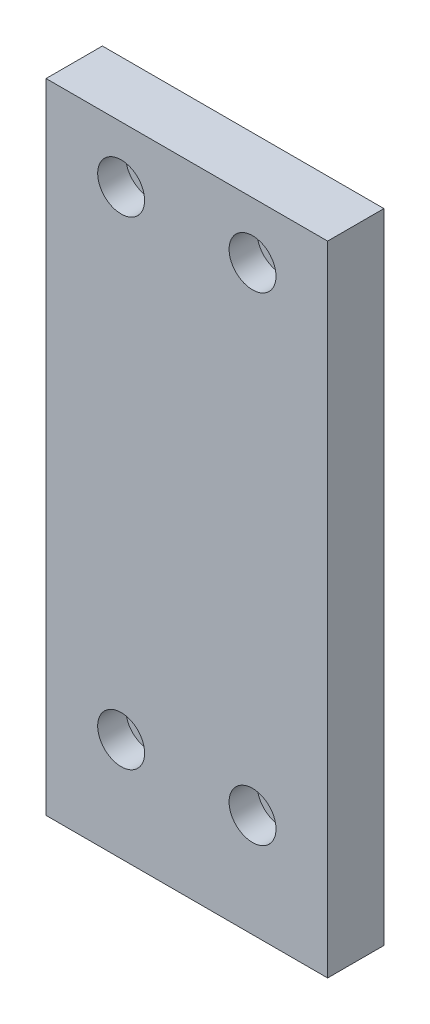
from build123d import *

# Parameters (mm, degrees)
SKETCH1_W                                        = 95.25
SKETCH1_H                                        = 19.05
EXTRUDE1_DEPTH                                   = 215.9
F_3_8_16_TAPPED_HOLE1_D                          = 7.9375
F_3_8_16_TAPPED_HOLE1_DEPTH                      = 26.924
F_3_8_16_TAPPED_HOLE1_TIP                        = 2.384665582
CBORE_FOR_3_8_SOCKET_HEAD_CAP_SCREW1_D           = 10.0838
CBORE_FOR_3_8_SOCKET_HEAD_CAP_SCREW1_CBORE_D     = 15.875
CBORE_FOR_3_8_SOCKET_HEAD_CAP_SCREW1_CBORE_DEPTH = 9.525


with BuildPart() as part:
    # Sketch1 → Extrude1 (new body)
    with BuildSketch(Plane(origin=(0, 0, 0), x_dir=(1, 0, 0), z_dir=(0, 1, 0))):
        with Locations((47.625, 9.525)):
            Rectangle(SKETCH1_W, SKETCH1_H)
    extrude(amount=EXTRUDE1_DEPTH)

    # 3_8-16 Tapped Hole1
    with Locations(Plane.XZ):
        with Locations((9.525, -9.525), (85.725, -9.525)):
            Hole(F_3_8_16_TAPPED_HOLE1_D / 2, depth=F_3_8_16_TAPPED_HOLE1_DEPTH)
            with Locations((0, 0, -(F_3_8_16_TAPPED_HOLE1_DEPTH + F_3_8_16_TAPPED_HOLE1_TIP / 2))):  # 118° drill point
                Cone(0, F_3_8_16_TAPPED_HOLE1_D / 2, F_3_8_16_TAPPED_HOLE1_TIP, mode=Mode.SUBTRACT)

    # CBORE for 3_8 Socket Head Cap Screw1 (through all)
    with Locations(Plane.XY):
        with Locations((25.4, 34.925), (69.85, 34.925), (69.85, 196.85), (25.4, 196.85)):
            CounterBoreHole(CBORE_FOR_3_8_SOCKET_HEAD_CAP_SCREW1_D / 2, CBORE_FOR_3_8_SOCKET_HEAD_CAP_SCREW1_CBORE_D / 2, CBORE_FOR_3_8_SOCKET_HEAD_CAP_SCREW1_CBORE_DEPTH)


solid = part.part
